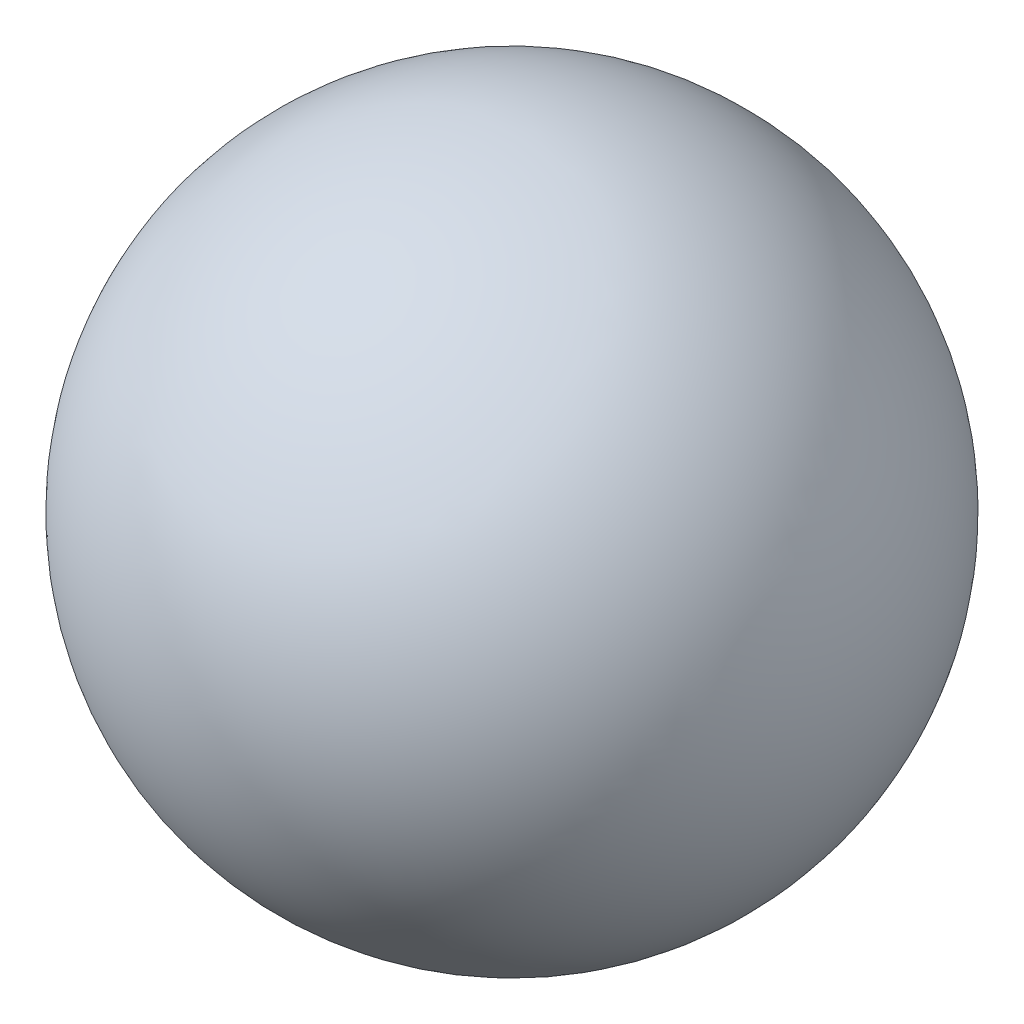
from build123d import *


with BuildPart() as part:
    # Sketch2 → Revolve1 (revolve)
    with BuildSketch(Plane.XY):
        with BuildLine():
            Line((-19.05, 19.05), (19.05, 19.05))
            ThreePointArc((19.05, 19.05), (0, 38.1), (-19.05, 19.05))
        make_face()
    revolve(axis=Axis((-19.05, 19.05, 0), (1, 0, 0)))


solid = part.part
